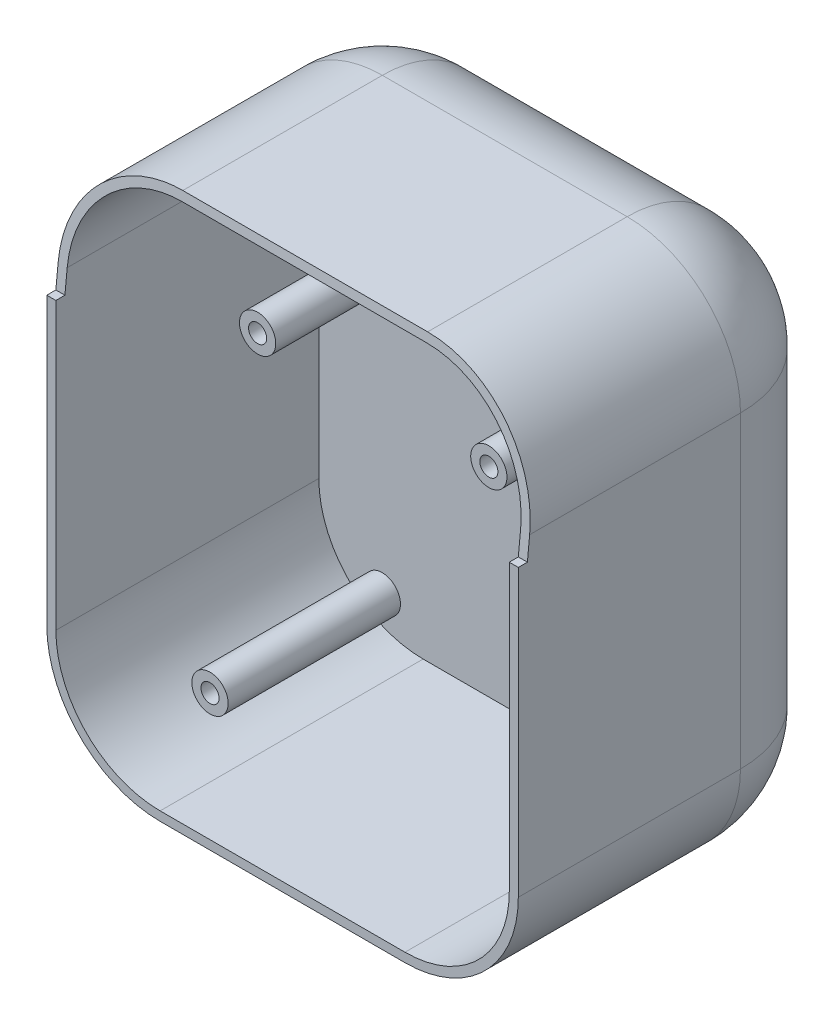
ISO-10303-21;
HEADER;
FILE_DESCRIPTION(('STEP AP214'),'2;1');
FILE_NAME('part.step','',(''),(''),'','','');
FILE_SCHEMA(('AUTOMOTIVE_DESIGN { 1 0 10303 214 1 1 1 1 }'));
ENDSEC;
DATA;
#1=APPLICATION_CONTEXT('core data for automotive mechanical design processes');
#2=APPLICATION_PROTOCOL_DEFINITION('international standard','automotive_design',2000,#1);
#3=PRODUCT_CONTEXT('',#1,'mechanical');
#4=PRODUCT('Part','Part','',(#3));
#5=PRODUCT_RELATED_PRODUCT_CATEGORY('part','',(#4));
#6=PRODUCT_DEFINITION_FORMATION('','',#4);
#7=PRODUCT_DEFINITION_CONTEXT('part definition',#1,'design');
#8=PRODUCT_DEFINITION('design','',#6,#7);
#9=PRODUCT_DEFINITION_SHAPE('','',#8);
#10=(LENGTH_UNIT() NAMED_UNIT(*) SI_UNIT(.MILLI.,.METRE.));
#11=(NAMED_UNIT(*) PLANE_ANGLE_UNIT() SI_UNIT($,.RADIAN.));
#12=(NAMED_UNIT(*) SI_UNIT($,.STERADIAN.) SOLID_ANGLE_UNIT());
#13=UNCERTAINTY_MEASURE_WITH_UNIT(LENGTH_MEASURE(1.E-05),#10,'distance_accuracy_value','');
#14=(GEOMETRIC_REPRESENTATION_CONTEXT(3) GLOBAL_UNCERTAINTY_ASSIGNED_CONTEXT((#13)) GLOBAL_UNIT_ASSIGNED_CONTEXT((#10,
#11,#12)) REPRESENTATION_CONTEXT('',''));
#15=CARTESIAN_POINT('',(0.,0.,0.));
#16=DIRECTION('',(0.,0.,1.));
#17=DIRECTION('',(1.,0.,0.));
#18=AXIS2_PLACEMENT_3D('',#15,#16,#17);
#19=CARTESIAN_POINT('',(-36.,-49.,-0.001000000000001));
#20=DIRECTION('',(0.,0.,1.));
#21=DIRECTION('',(1.,0.,0.));
#22=AXIS2_PLACEMENT_3D('',#19,#20,#21);
#23=CYLINDRICAL_SURFACE('',#22,4.);
#24=CARTESIAN_POINT('',(-36.,-49.,2.));
#25=DIRECTION('',(0.,0.,1.));
#26=DIRECTION('',(1.,0.,0.));
#27=AXIS2_PLACEMENT_3D('',#24,#25,#26);
#28=CIRCLE('',#27,4.);
#29=CARTESIAN_POINT('',(-32.,-49.,2.));
#30=VERTEX_POINT('',#29);
#31=EDGE_CURVE('E611',#30,#30,#28,.F.);
#32=ORIENTED_EDGE('',*,*,#31,.F.);
#33=EDGE_LOOP('',(#32));
#34=FACE_BOUND('',#33,.T.);
#35=CARTESIAN_POINT('',(-36.,-49.,40.));
#36=DIRECTION('',(0.,0.,1.));
#37=DIRECTION('',(1.,0.,0.));
#38=AXIS2_PLACEMENT_3D('',#35,#36,#37);
#39=CIRCLE('',#38,4.00000000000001);
#40=CARTESIAN_POINT('',(-32.,-49.,40.));
#41=VERTEX_POINT('',#40);
#42=EDGE_CURVE('E548',#41,#41,#39,.T.);
#43=ORIENTED_EDGE('',*,*,#42,.F.);
#44=EDGE_LOOP('',(#43));
#45=FACE_BOUND('',#44,.T.);
#46=ADVANCED_FACE('F348',(#34,#45),#23,.T.);
#47=CARTESIAN_POINT('',(-25.5,25.,-0.001000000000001));
#48=DIRECTION('',(0.,0.,1.));
#49=DIRECTION('',(1.,0.,0.));
#50=AXIS2_PLACEMENT_3D('',#47,#48,#49);
#51=CYLINDRICAL_SURFACE('',#50,4.);
#52=CARTESIAN_POINT('',(-25.5,25.,2.));
#53=DIRECTION('',(0.,0.,1.));
#54=DIRECTION('',(1.,0.,0.));
#55=AXIS2_PLACEMENT_3D('',#52,#53,#54);
#56=CIRCLE('',#55,4.);
#57=CARTESIAN_POINT('',(-21.5,25.,2.));
#58=VERTEX_POINT('',#57);
#59=EDGE_CURVE('E653',#58,#58,#56,.F.);
#60=ORIENTED_EDGE('',*,*,#59,.F.);
#61=EDGE_LOOP('',(#60));
#62=FACE_BOUND('',#61,.T.);
#63=CARTESIAN_POINT('',(-25.5,25.,40.));
#64=DIRECTION('',(0.,0.,1.));
#65=DIRECTION('',(1.,0.,0.));
#66=AXIS2_PLACEMENT_3D('',#63,#64,#65);
#67=CIRCLE('',#66,4.);
#68=CARTESIAN_POINT('',(-21.5,25.,40.));
#69=VERTEX_POINT('',#68);
#70=EDGE_CURVE('E554',#69,#69,#67,.T.);
#71=ORIENTED_EDGE('',*,*,#70,.F.);
#72=EDGE_LOOP('',(#71));
#73=FACE_BOUND('',#72,.T.);
#74=ADVANCED_FACE('F831',(#62,#73),#51,.T.);
#75=CARTESIAN_POINT('',(25.5,25.,-0.001000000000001));
#76=DIRECTION('',(0.,0.,1.));
#77=DIRECTION('',(1.,0.,0.));
#78=AXIS2_PLACEMENT_3D('',#75,#76,#77);
#79=CYLINDRICAL_SURFACE('',#78,4.);
#80=CARTESIAN_POINT('',(25.5,25.,2.));
#81=DIRECTION('',(0.,0.,1.));
#82=DIRECTION('',(1.,0.,0.));
#83=AXIS2_PLACEMENT_3D('',#80,#81,#82);
#84=CIRCLE('',#83,4.);
#85=CARTESIAN_POINT('',(29.5,25.,2.));
#86=VERTEX_POINT('',#85);
#87=EDGE_CURVE('E606',#86,#86,#84,.F.);
#88=ORIENTED_EDGE('',*,*,#87,.F.);
#89=EDGE_LOOP('',(#88));
#90=FACE_BOUND('',#89,.T.);
#91=CARTESIAN_POINT('',(25.5,25.,40.));
#92=DIRECTION('',(0.,0.,1.));
#93=DIRECTION('',(1.,0.,0.));
#94=AXIS2_PLACEMENT_3D('',#91,#92,#93);
#95=CIRCLE('',#94,4.);
#96=CARTESIAN_POINT('',(29.5,25.,40.));
#97=VERTEX_POINT('',#96);
#98=EDGE_CURVE('E560',#97,#97,#95,.T.);
#99=ORIENTED_EDGE('',*,*,#98,.F.);
#100=EDGE_LOOP('',(#99));
#101=FACE_BOUND('',#100,.T.);
#102=ADVANCED_FACE('F838',(#90,#101),#79,.T.);
#103=CARTESIAN_POINT('',(36.,-49.,-0.001000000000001));
#104=DIRECTION('',(0.,0.,1.));
#105=DIRECTION('',(1.,0.,0.));
#106=AXIS2_PLACEMENT_3D('',#103,#104,#105);
#107=CYLINDRICAL_SURFACE('',#106,4.);
#108=CARTESIAN_POINT('',(36.,-49.,2.));
#109=DIRECTION('',(0.,0.,1.));
#110=DIRECTION('',(1.,0.,0.));
#111=AXIS2_PLACEMENT_3D('',#108,#109,#110);
#112=CIRCLE('',#111,4.);
#113=CARTESIAN_POINT('',(40.,-49.,2.));
#114=VERTEX_POINT('',#113);
#115=EDGE_CURVE('E656',#114,#114,#112,.F.);
#116=ORIENTED_EDGE('',*,*,#115,.F.);
#117=EDGE_LOOP('',(#116));
#118=FACE_BOUND('',#117,.T.);
#119=CARTESIAN_POINT('',(36.,-49.,40.));
#120=DIRECTION('',(0.,0.,1.));
#121=DIRECTION('',(1.,0.,0.));
#122=AXIS2_PLACEMENT_3D('',#119,#120,#121);
#123=CIRCLE('',#122,4.00000000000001);
#124=CARTESIAN_POINT('',(40.,-49.,40.));
#125=VERTEX_POINT('',#124);
#126=EDGE_CURVE('E566',#125,#125,#123,.T.);
#127=ORIENTED_EDGE('',*,*,#126,.F.);
#128=EDGE_LOOP('',(#127));
#129=FACE_BOUND('',#128,.T.);
#130=ADVANCED_FACE('F846',(#118,#129),#107,.T.);
#131=CARTESIAN_POINT('',(-27.,34.,60.));
#132=DIRECTION('',(0.,0.,-1.));
#133=DIRECTION('',(-1.,0.,0.));
#134=AXIS2_PLACEMENT_3D('',#131,#132,#133);
#135=CYLINDRICAL_SURFACE('',#134,25.);
#136=DIRECTION('',(0.,0.,-1.));
#137=VECTOR('',#136,1.);
#138=CARTESIAN_POINT('',(-52.,34.,60.));
#139=LINE('',#138,#137);
#140=CARTESIAN_POINT('',(-52.,34.,57.5));
#141=VERTEX_POINT('',#140);
#142=CARTESIAN_POINT('',(-52.,34.,11.));
#143=VERTEX_POINT('',#142);
#144=EDGE_CURVE('E695',#141,#143,#139,.T.);
#145=ORIENTED_EDGE('',*,*,#144,.F.);
#146=CARTESIAN_POINT('',(-27.,34.,57.5));
#147=DIRECTION('',(0.,-0.0995037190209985,-0.995037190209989));
#148=DIRECTION('',(0.,0.995037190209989,-0.0995037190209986));
#149=AXIS2_PLACEMENT_3D('',#146,#147,#148);
#150=ELLIPSE('',#149,25.1246890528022,25.);
#151=CARTESIAN_POINT('',(-27.,59.,55.));
#152=VERTEX_POINT('',#151);
#153=EDGE_CURVE('E542',#141,#152,#150,.T.);
#154=ORIENTED_EDGE('',*,*,#153,.T.);
#155=DIRECTION('',(0.,0.,-1.));
#156=VECTOR('',#155,1.);
#157=CARTESIAN_POINT('',(-27.,59.,60.));
#158=LINE('',#157,#156);
#159=CARTESIAN_POINT('',(-27.,59.,11.));
#160=VERTEX_POINT('',#159);
#161=EDGE_CURVE('E371',#152,#160,#158,.T.);
#162=ORIENTED_EDGE('',*,*,#161,.T.);
#163=CARTESIAN_POINT('',(-27.,34.,11.));
#164=DIRECTION('',(0.,0.,-1.));
#165=DIRECTION('',(-1.,0.,0.));
#166=AXIS2_PLACEMENT_3D('',#163,#164,#165);
#167=CIRCLE('',#166,25.);
#168=EDGE_CURVE('E722',#160,#143,#167,.F.);
#169=ORIENTED_EDGE('',*,*,#168,.T.);
#170=EDGE_LOOP('',(#145,#154,#162,#169));
#171=FACE_BOUND('',#170,.T.);
#172=ADVANCED_FACE('F350',(#171),#135,.T.);
#173=CARTESIAN_POINT('',(-52.,34.,60.));
#174=DIRECTION('',(1.,0.,0.));
#175=DIRECTION('',(0.,1.,0.));
#176=AXIS2_PLACEMENT_3D('',#173,#174,#175);
#177=PLANE('',#176);
#178=DIRECTION('',(0.,0.,-1.));
#179=VECTOR('',#178,1.);
#180=CARTESIAN_POINT('',(-52.,29.,63.3901111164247));
#181=LINE('',#180,#179);
#182=CARTESIAN_POINT('',(-52.,29.,60.));
#183=VERTEX_POINT('',#182);
#184=CARTESIAN_POINT('',(-52.,29.,58.));
#185=VERTEX_POINT('',#184);
#186=EDGE_CURVE('E523',#183,#185,#181,.T.);
#187=ORIENTED_EDGE('',*,*,#186,.T.);
#188=DIRECTION('',(0.,0.995037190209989,-0.0995037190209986));
#189=VECTOR('',#188,1.);
#190=CARTESIAN_POINT('',(-52.,59.,55.));
#191=LINE('',#190,#189);
#192=EDGE_CURVE('E517',#185,#141,#191,.T.);
#193=ORIENTED_EDGE('',*,*,#192,.T.);
#194=ORIENTED_EDGE('',*,*,#144,.T.);
#195=DIRECTION('',(0.,1.,0.));
#196=VECTOR('',#195,1.);
#197=CARTESIAN_POINT('',(-52.,-34.,11.));
#198=LINE('',#197,#196);
#199=CARTESIAN_POINT('',(-52.,-34.,11.));
#200=VERTEX_POINT('',#199);
#201=EDGE_CURVE('E706',#143,#200,#198,.F.);
#202=ORIENTED_EDGE('',*,*,#201,.T.);
#203=DIRECTION('',(0.,0.,-1.));
#204=VECTOR('',#203,1.);
#205=CARTESIAN_POINT('',(-52.,-34.,60.));
#206=LINE('',#205,#204);
#207=CARTESIAN_POINT('',(-52.,-34.,60.));
#208=VERTEX_POINT('',#207);
#209=EDGE_CURVE('E692',#208,#200,#206,.T.);
#210=ORIENTED_EDGE('',*,*,#209,.F.);
#211=DIRECTION('',(0.,-1.,0.));
#212=VECTOR('',#211,1.);
#213=CARTESIAN_POINT('',(-52.,34.,60.));
#214=LINE('',#213,#212);
#215=EDGE_CURVE('E614',#183,#208,#214,.T.);
#216=ORIENTED_EDGE('',*,*,#215,.F.);
#217=EDGE_LOOP('',(#187,#193,#194,#202,#210,#216));
#218=FACE_BOUND('',#217,.T.);
#219=ADVANCED_FACE('F806',(#218),#177,.F.);
#220=CARTESIAN_POINT('',(-27.,-34.,60.));
#221=DIRECTION('',(0.,0.,-1.));
#222=DIRECTION('',(-1.,0.,0.));
#223=AXIS2_PLACEMENT_3D('',#220,#221,#222);
#224=CYLINDRICAL_SURFACE('',#223,25.);
#225=ORIENTED_EDGE('',*,*,#209,.T.);
#226=CARTESIAN_POINT('',(-27.,-34.,11.));
#227=DIRECTION('',(0.,0.,-1.));
#228=DIRECTION('',(-1.,0.,0.));
#229=AXIS2_PLACEMENT_3D('',#226,#227,#228);
#230=CIRCLE('',#229,25.);
#231=CARTESIAN_POINT('',(-27.,-59.,11.));
#232=VERTEX_POINT('',#231);
#233=EDGE_CURVE('E709',#200,#232,#230,.F.);
#234=ORIENTED_EDGE('',*,*,#233,.T.);
#235=DIRECTION('',(0.,0.,-1.));
#236=VECTOR('',#235,1.);
#237=CARTESIAN_POINT('',(-27.,-59.,60.));
#238=LINE('',#237,#236);
#239=CARTESIAN_POINT('',(-27.,-59.,60.));
#240=VERTEX_POINT('',#239);
#241=EDGE_CURVE('E689',#240,#232,#238,.T.);
#242=ORIENTED_EDGE('',*,*,#241,.F.);
#243=CARTESIAN_POINT('',(-27.,-34.,60.));
#244=DIRECTION('',(0.,0.,1.));
#245=DIRECTION('',(1.,0.,0.));
#246=AXIS2_PLACEMENT_3D('',#243,#244,#245);
#247=CIRCLE('',#246,25.);
#248=EDGE_CURVE('E671',#208,#240,#247,.T.);
#249=ORIENTED_EDGE('',*,*,#248,.F.);
#250=EDGE_LOOP('',(#225,#234,#242,#249));
#251=FACE_BOUND('',#250,.T.);
#252=ADVANCED_FACE('F815',(#251),#224,.T.);
#253=CARTESIAN_POINT('',(27.,-59.,60.));
#254=DIRECTION('',(0.,1.,0.));
#255=DIRECTION('',(0.,0.,1.));
#256=AXIS2_PLACEMENT_3D('',#253,#254,#255);
#257=PLANE('',#256);
#258=ORIENTED_EDGE('',*,*,#241,.T.);
#259=DIRECTION('',(-1.,0.,0.));
#260=VECTOR('',#259,1.);
#261=CARTESIAN_POINT('',(27.,-59.,11.));
#262=LINE('',#261,#260);
#263=CARTESIAN_POINT('',(27.,-59.,11.));
#264=VERTEX_POINT('',#263);
#265=EDGE_CURVE('E711',#232,#264,#262,.F.);
#266=ORIENTED_EDGE('',*,*,#265,.T.);
#267=DIRECTION('',(0.,0.,-1.));
#268=VECTOR('',#267,1.);
#269=CARTESIAN_POINT('',(27.,-59.,60.));
#270=LINE('',#269,#268);
#271=CARTESIAN_POINT('',(27.,-59.,60.));
#272=VERTEX_POINT('',#271);
#273=EDGE_CURVE('E686',#272,#264,#270,.T.);
#274=ORIENTED_EDGE('',*,*,#273,.F.);
#275=DIRECTION('',(1.,0.,0.));
#276=VECTOR('',#275,1.);
#277=CARTESIAN_POINT('',(27.,-59.,60.));
#278=LINE('',#277,#276);
#279=EDGE_CURVE('E673',#240,#272,#278,.T.);
#280=ORIENTED_EDGE('',*,*,#279,.F.);
#281=EDGE_LOOP('',(#258,#266,#274,#280));
#282=FACE_BOUND('',#281,.T.);
#283=ADVANCED_FACE('F819',(#282),#257,.F.);
#284=CARTESIAN_POINT('',(27.,-34.,60.));
#285=DIRECTION('',(0.,0.,-1.));
#286=DIRECTION('',(-1.,0.,0.));
#287=AXIS2_PLACEMENT_3D('',#284,#285,#286);
#288=CYLINDRICAL_SURFACE('',#287,25.);
#289=ORIENTED_EDGE('',*,*,#273,.T.);
#290=CARTESIAN_POINT('',(27.,-34.,11.));
#291=DIRECTION('',(0.,0.,-1.));
#292=DIRECTION('',(-1.,0.,0.));
#293=AXIS2_PLACEMENT_3D('',#290,#291,#292);
#294=CIRCLE('',#293,25.);
#295=CARTESIAN_POINT('',(52.,-34.,11.));
#296=VERTEX_POINT('',#295);
#297=EDGE_CURVE('E713',#264,#296,#294,.F.);
#298=ORIENTED_EDGE('',*,*,#297,.T.);
#299=DIRECTION('',(0.,0.,-1.));
#300=VECTOR('',#299,1.);
#301=CARTESIAN_POINT('',(52.,-34.,60.));
#302=LINE('',#301,#300);
#303=CARTESIAN_POINT('',(52.,-34.,60.));
#304=VERTEX_POINT('',#303);
#305=EDGE_CURVE('E683',#304,#296,#302,.T.);
#306=ORIENTED_EDGE('',*,*,#305,.F.);
#307=CARTESIAN_POINT('',(27.,-34.,60.));
#308=DIRECTION('',(0.,0.,1.));
#309=DIRECTION('',(1.,0.,0.));
#310=AXIS2_PLACEMENT_3D('',#307,#308,#309);
#311=CIRCLE('',#310,25.);
#312=EDGE_CURVE('E675',#272,#304,#311,.T.);
#313=ORIENTED_EDGE('',*,*,#312,.F.);
#314=EDGE_LOOP('',(#289,#298,#306,#313));
#315=FACE_BOUND('',#314,.T.);
#316=ADVANCED_FACE('F820',(#315),#288,.T.);
#317=CARTESIAN_POINT('',(52.,34.,60.));
#318=DIRECTION('',(-1.,0.,0.));
#319=DIRECTION('',(0.,0.,1.));
#320=AXIS2_PLACEMENT_3D('',#317,#318,#319);
#321=PLANE('',#320);
#322=DIRECTION('',(0.,0.,-1.));
#323=VECTOR('',#322,1.);
#324=CARTESIAN_POINT('',(52.,34.,60.));
#325=LINE('',#324,#323);
#326=CARTESIAN_POINT('',(52.,34.,57.5));
#327=VERTEX_POINT('',#326);
#328=CARTESIAN_POINT('',(52.,34.,11.));
#329=VERTEX_POINT('',#328);
#330=EDGE_CURVE('E522',#327,#329,#325,.T.);
#331=ORIENTED_EDGE('',*,*,#330,.F.);
#332=DIRECTION('',(0.,0.995037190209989,-0.0995037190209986));
#333=VECTOR('',#332,1.);
#334=CARTESIAN_POINT('',(52.,59.,55.));
#335=LINE('',#334,#333);
#336=CARTESIAN_POINT('',(52.,29.,58.));
#337=VERTEX_POINT('',#336);
#338=EDGE_CURVE('E509',#337,#327,#335,.T.);
#339=ORIENTED_EDGE('',*,*,#338,.F.);
#340=DIRECTION('',(0.,0.,-1.));
#341=VECTOR('',#340,1.);
#342=CARTESIAN_POINT('',(52.,29.,63.3901111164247));
#343=LINE('',#342,#341);
#344=CARTESIAN_POINT('',(52.,29.,60.));
#345=VERTEX_POINT('',#344);
#346=EDGE_CURVE('E498',#345,#337,#343,.T.);
#347=ORIENTED_EDGE('',*,*,#346,.F.);
#348=DIRECTION('',(0.,1.,0.));
#349=VECTOR('',#348,1.);
#350=CARTESIAN_POINT('',(52.,34.,60.));
#351=LINE('',#350,#349);
#352=EDGE_CURVE('E677',#304,#345,#351,.T.);
#353=ORIENTED_EDGE('',*,*,#352,.F.);
#354=ORIENTED_EDGE('',*,*,#305,.T.);
#355=DIRECTION('',(0.,-1.,0.));
#356=VECTOR('',#355,1.);
#357=CARTESIAN_POINT('',(52.,34.,11.));
#358=LINE('',#357,#356);
#359=EDGE_CURVE('E715',#296,#329,#358,.F.);
#360=ORIENTED_EDGE('',*,*,#359,.T.);
#361=EDGE_LOOP('',(#331,#339,#347,#353,#354,#360));
#362=FACE_BOUND('',#361,.T.);
#363=ADVANCED_FACE('F520',(#362),#321,.F.);
#364=CARTESIAN_POINT('',(27.,34.,60.));
#365=DIRECTION('',(0.,0.,-1.));
#366=DIRECTION('',(-1.,0.,0.));
#367=AXIS2_PLACEMENT_3D('',#364,#365,#366);
#368=CYLINDRICAL_SURFACE('',#367,25.);
#369=DIRECTION('',(0.,0.,-1.));
#370=VECTOR('',#369,1.);
#371=CARTESIAN_POINT('',(27.,59.,60.));
#372=LINE('',#371,#370);
#373=CARTESIAN_POINT('',(27.,59.,55.));
#374=VERTEX_POINT('',#373);
#375=CARTESIAN_POINT('',(27.,59.,11.));
#376=VERTEX_POINT('',#375);
#377=EDGE_CURVE('E680',#374,#376,#372,.T.);
#378=ORIENTED_EDGE('',*,*,#377,.F.);
#379=CARTESIAN_POINT('',(27.,34.,57.5));
#380=DIRECTION('',(0.,-0.0995037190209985,-0.995037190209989));
#381=DIRECTION('',(0.,0.995037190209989,-0.0995037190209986));
#382=AXIS2_PLACEMENT_3D('',#379,#380,#381);
#383=ELLIPSE('',#382,25.1246890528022,25.);
#384=EDGE_CURVE('E540',#374,#327,#383,.T.);
#385=ORIENTED_EDGE('',*,*,#384,.T.);
#386=ORIENTED_EDGE('',*,*,#330,.T.);
#387=CARTESIAN_POINT('',(27.,34.,11.));
#388=DIRECTION('',(0.,0.,-1.));
#389=DIRECTION('',(-1.,0.,0.));
#390=AXIS2_PLACEMENT_3D('',#387,#388,#389);
#391=CIRCLE('',#390,25.);
#392=EDGE_CURVE('E717',#329,#376,#391,.F.);
#393=ORIENTED_EDGE('',*,*,#392,.T.);
#394=EDGE_LOOP('',(#378,#385,#386,#393));
#395=FACE_BOUND('',#394,.T.);
#396=ADVANCED_FACE('F802',(#395),#368,.T.);
#397=CARTESIAN_POINT('',(27.,59.,60.));
#398=DIRECTION('',(0.,-1.,0.));
#399=DIRECTION('',(1.,0.,0.));
#400=AXIS2_PLACEMENT_3D('',#397,#398,#399);
#401=PLANE('',#400);
#402=ORIENTED_EDGE('',*,*,#161,.F.);
#403=DIRECTION('',(1.,0.,0.));
#404=VECTOR('',#403,1.);
#405=CARTESIAN_POINT('',(-52.,59.,55.));
#406=LINE('',#405,#404);
#407=EDGE_CURVE('E530',#152,#374,#406,.T.);
#408=ORIENTED_EDGE('',*,*,#407,.T.);
#409=ORIENTED_EDGE('',*,*,#377,.T.);
#410=DIRECTION('',(1.,0.,0.));
#411=VECTOR('',#410,1.);
#412=CARTESIAN_POINT('',(-27.,59.,11.));
#413=LINE('',#412,#411);
#414=EDGE_CURVE('E720',#376,#160,#413,.F.);
#415=ORIENTED_EDGE('',*,*,#414,.T.);
#416=EDGE_LOOP('',(#402,#408,#409,#415));
#417=FACE_BOUND('',#416,.T.);
#418=ADVANCED_FACE('F799',(#417),#401,.F.);
#419=CARTESIAN_POINT('',(-27.,34.,60.));
#420=DIRECTION('',(0.,0.,1.));
#421=DIRECTION('',(1.,0.,0.));
#422=AXIS2_PLACEMENT_3D('',#419,#420,#421);
#423=PLANE('',#422);
#424=DIRECTION('',(1.,0.,0.));
#425=VECTOR('',#424,1.);
#426=CARTESIAN_POINT('',(-27.,29.,60.));
#427=LINE('',#426,#425);
#428=CARTESIAN_POINT('',(-50.,29.,60.));
#429=VERTEX_POINT('',#428);
#430=EDGE_CURVE('E546',#183,#429,#427,.T.);
#431=ORIENTED_EDGE('',*,*,#430,.F.);
#432=ORIENTED_EDGE('',*,*,#215,.T.);
#433=ORIENTED_EDGE('',*,*,#248,.T.);
#434=ORIENTED_EDGE('',*,*,#279,.T.);
#435=ORIENTED_EDGE('',*,*,#312,.T.);
#436=ORIENTED_EDGE('',*,*,#352,.T.);
#437=CARTESIAN_POINT('',(50.,29.,60.));
#438=VERTEX_POINT('',#437);
#439=EDGE_CURVE('E504',#438,#345,#427,.T.);
#440=ORIENTED_EDGE('',*,*,#439,.F.);
#441=DIRECTION('',(0.,1.,0.));
#442=VECTOR('',#441,1.);
#443=CARTESIAN_POINT('',(50.,34.,60.));
#444=LINE('',#443,#442);
#445=CARTESIAN_POINT('',(50.,-34.,60.));
#446=VERTEX_POINT('',#445);
#447=EDGE_CURVE('E619',#446,#438,#444,.T.);
#448=ORIENTED_EDGE('',*,*,#447,.F.);
#449=CARTESIAN_POINT('',(27.,-34.,60.));
#450=DIRECTION('',(0.,0.,1.));
#451=DIRECTION('',(1.,0.,0.));
#452=AXIS2_PLACEMENT_3D('',#449,#450,#451);
#453=CIRCLE('',#452,23.);
#454=CARTESIAN_POINT('',(27.,-57.,60.));
#455=VERTEX_POINT('',#454);
#456=EDGE_CURVE('E666',#455,#446,#453,.T.);
#457=ORIENTED_EDGE('',*,*,#456,.F.);
#458=DIRECTION('',(1.,0.,0.));
#459=VECTOR('',#458,1.);
#460=CARTESIAN_POINT('',(27.,-57.,60.));
#461=LINE('',#460,#459);
#462=CARTESIAN_POINT('',(-27.,-57.,60.));
#463=VERTEX_POINT('',#462);
#464=EDGE_CURVE('E664',#463,#455,#461,.T.);
#465=ORIENTED_EDGE('',*,*,#464,.F.);
#466=CARTESIAN_POINT('',(-27.,-34.,60.));
#467=DIRECTION('',(0.,0.,1.));
#468=DIRECTION('',(1.,0.,0.));
#469=AXIS2_PLACEMENT_3D('',#466,#467,#468);
#470=CIRCLE('',#469,23.);
#471=CARTESIAN_POINT('',(-50.,-34.,60.));
#472=VERTEX_POINT('',#471);
#473=EDGE_CURVE('E662',#472,#463,#470,.T.);
#474=ORIENTED_EDGE('',*,*,#473,.F.);
#475=DIRECTION('',(0.,-1.,0.));
#476=VECTOR('',#475,1.);
#477=CARTESIAN_POINT('',(-50.,34.,60.));
#478=LINE('',#477,#476);
#479=EDGE_CURVE('E650',#429,#472,#478,.T.);
#480=ORIENTED_EDGE('',*,*,#479,.F.);
#481=EDGE_LOOP('',(#431,#432,#433,#434,#435,#436,#440,#448,#457,#465,#474,#480));
#482=FACE_BOUND('',#481,.T.);
#483=ADVANCED_FACE('F765',(#482),#423,.T.);
#484=CARTESIAN_POINT('',(-27.,34.,60.));
#485=DIRECTION('',(0.,0.,-1.));
#486=DIRECTION('',(-1.,0.,0.));
#487=AXIS2_PLACEMENT_3D('',#484,#485,#486);
#488=CYLINDRICAL_SURFACE('',#487,23.);
#489=CARTESIAN_POINT('',(-27.,34.,57.5));
#490=DIRECTION('',(0.,-0.0995037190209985,-0.995037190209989));
#491=DIRECTION('',(0.,0.995037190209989,-0.0995037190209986));
#492=AXIS2_PLACEMENT_3D('',#489,#490,#491);
#493=ELLIPSE('',#492,23.114713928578,23.);
#494=CARTESIAN_POINT('',(-50.,34.,57.5));
#495=VERTEX_POINT('',#494);
#496=CARTESIAN_POINT('',(-27.,57.,55.2));
#497=VERTEX_POINT('',#496);
#498=EDGE_CURVE('E363',#495,#497,#493,.T.);
#499=ORIENTED_EDGE('',*,*,#498,.F.);
#500=DIRECTION('',(0.,0.,1.));
#501=VECTOR('',#500,1.);
#502=CARTESIAN_POINT('',(-50.,34.,60.));
#503=LINE('',#502,#501);
#504=CARTESIAN_POINT('',(-50.,34.,2.));
#505=VERTEX_POINT('',#504);
#506=EDGE_CURVE('E612',#495,#505,#503,.F.);
#507=ORIENTED_EDGE('',*,*,#506,.T.);
#508=CARTESIAN_POINT('',(-27.,34.,2.));
#509=DIRECTION('',(0.,0.,1.));
#510=DIRECTION('',(1.,0.,0.));
#511=AXIS2_PLACEMENT_3D('',#508,#509,#510);
#512=CIRCLE('',#511,23.);
#513=CARTESIAN_POINT('',(-27.,57.,2.));
#514=VERTEX_POINT('',#513);
#515=EDGE_CURVE('E607',#514,#505,#512,.T.);
#516=ORIENTED_EDGE('',*,*,#515,.F.);
#517=DIRECTION('',(0.,0.,-1.));
#518=VECTOR('',#517,1.);
#519=CARTESIAN_POINT('',(-27.,57.,60.));
#520=LINE('',#519,#518);
#521=EDGE_CURVE('E616',#497,#514,#520,.T.);
#522=ORIENTED_EDGE('',*,*,#521,.F.);
#523=EDGE_LOOP('',(#499,#507,#516,#522));
#524=FACE_BOUND('',#523,.T.);
#525=ADVANCED_FACE('F737',(#524),#488,.F.);
#526=CARTESIAN_POINT('',(-50.,34.,60.));
#527=DIRECTION('',(1.,0.,0.));
#528=DIRECTION('',(0.,1.,0.));
#529=AXIS2_PLACEMENT_3D('',#526,#527,#528);
#530=PLANE('',#529);
#531=DIRECTION('',(0.,0.995037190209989,-0.0995037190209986));
#532=VECTOR('',#531,1.);
#533=CARTESIAN_POINT('',(-50.,33.7524752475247,57.5247524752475));
#534=LINE('',#533,#532);
#535=CARTESIAN_POINT('',(-50.,29.,58.));
#536=VERTEX_POINT('',#535);
#537=EDGE_CURVE('E538',#536,#495,#534,.T.);
#538=ORIENTED_EDGE('',*,*,#537,.F.);
#539=DIRECTION('',(0.,0.,-1.));
#540=VECTOR('',#539,1.);
#541=CARTESIAN_POINT('',(-50.,29.,60.));
#542=LINE('',#541,#540);
#543=EDGE_CURVE('E545',#429,#536,#542,.T.);
#544=ORIENTED_EDGE('',*,*,#543,.F.);
#545=ORIENTED_EDGE('',*,*,#479,.T.);
#546=DIRECTION('',(0.,0.,-1.));
#547=VECTOR('',#546,1.);
#548=CARTESIAN_POINT('',(-50.,-34.,60.));
#549=LINE('',#548,#547);
#550=CARTESIAN_POINT('',(-50.,-34.,2.));
#551=VERTEX_POINT('',#550);
#552=EDGE_CURVE('E615',#472,#551,#549,.T.);
#553=ORIENTED_EDGE('',*,*,#552,.T.);
#554=DIRECTION('',(0.,-1.,0.));
#555=VECTOR('',#554,1.);
#556=CARTESIAN_POINT('',(-50.,34.,2.));
#557=LINE('',#556,#555);
#558=EDGE_CURVE('E610',#505,#551,#557,.T.);
#559=ORIENTED_EDGE('',*,*,#558,.F.);
#560=ORIENTED_EDGE('',*,*,#506,.F.);
#561=EDGE_LOOP('',(#538,#544,#545,#553,#559,#560));
#562=FACE_BOUND('',#561,.T.);
#563=ADVANCED_FACE('F742',(#562),#530,.T.);
#564=CARTESIAN_POINT('',(-27.,-34.,60.));
#565=DIRECTION('',(0.,0.,-1.));
#566=DIRECTION('',(-1.,0.,0.));
#567=AXIS2_PLACEMENT_3D('',#564,#565,#566);
#568=CYLINDRICAL_SURFACE('',#567,23.);
#569=CARTESIAN_POINT('',(-27.,-34.,2.));
#570=DIRECTION('',(0.,0.,1.));
#571=DIRECTION('',(1.,0.,0.));
#572=AXIS2_PLACEMENT_3D('',#569,#570,#571);
#573=CIRCLE('',#572,23.);
#574=CARTESIAN_POINT('',(-27.,-57.,2.));
#575=VERTEX_POINT('',#574);
#576=EDGE_CURVE('E621',#551,#575,#573,.T.);
#577=ORIENTED_EDGE('',*,*,#576,.F.);
#578=ORIENTED_EDGE('',*,*,#552,.F.);
#579=ORIENTED_EDGE('',*,*,#473,.T.);
#580=DIRECTION('',(0.,0.,1.));
#581=VECTOR('',#580,1.);
#582=CARTESIAN_POINT('',(-27.,-57.,60.));
#583=LINE('',#582,#581);
#584=EDGE_CURVE('E624',#463,#575,#583,.F.);
#585=ORIENTED_EDGE('',*,*,#584,.T.);
#586=EDGE_LOOP('',(#577,#578,#579,#585));
#587=FACE_BOUND('',#586,.T.);
#588=ADVANCED_FACE('F748',(#587),#568,.F.);
#589=CARTESIAN_POINT('',(27.,-57.,60.));
#590=DIRECTION('',(0.,1.,0.));
#591=DIRECTION('',(0.,0.,1.));
#592=AXIS2_PLACEMENT_3D('',#589,#590,#591);
#593=PLANE('',#592);
#594=DIRECTION('',(1.,0.,0.));
#595=VECTOR('',#594,1.);
#596=CARTESIAN_POINT('',(27.,-57.,2.));
#597=LINE('',#596,#595);
#598=CARTESIAN_POINT('',(27.,-57.,2.));
#599=VERTEX_POINT('',#598);
#600=EDGE_CURVE('E626',#575,#599,#597,.T.);
#601=ORIENTED_EDGE('',*,*,#600,.F.);
#602=ORIENTED_EDGE('',*,*,#584,.F.);
#603=ORIENTED_EDGE('',*,*,#464,.T.);
#604=DIRECTION('',(0.,0.,-1.));
#605=VECTOR('',#604,1.);
#606=CARTESIAN_POINT('',(27.,-57.,60.));
#607=LINE('',#606,#605);
#608=EDGE_CURVE('E629',#455,#599,#607,.T.);
#609=ORIENTED_EDGE('',*,*,#608,.T.);
#610=EDGE_LOOP('',(#601,#602,#603,#609));
#611=FACE_BOUND('',#610,.T.);
#612=ADVANCED_FACE('F752',(#611),#593,.T.);
#613=CARTESIAN_POINT('',(27.,-34.,60.));
#614=DIRECTION('',(0.,0.,-1.));
#615=DIRECTION('',(-1.,0.,0.));
#616=AXIS2_PLACEMENT_3D('',#613,#614,#615);
#617=CYLINDRICAL_SURFACE('',#616,23.);
#618=CARTESIAN_POINT('',(27.,-34.,2.));
#619=DIRECTION('',(0.,0.,1.));
#620=DIRECTION('',(1.,0.,0.));
#621=AXIS2_PLACEMENT_3D('',#618,#619,#620);
#622=CIRCLE('',#621,23.);
#623=CARTESIAN_POINT('',(50.,-34.,2.));
#624=VERTEX_POINT('',#623);
#625=EDGE_CURVE('E631',#599,#624,#622,.T.);
#626=ORIENTED_EDGE('',*,*,#625,.F.);
#627=ORIENTED_EDGE('',*,*,#608,.F.);
#628=ORIENTED_EDGE('',*,*,#456,.T.);
#629=DIRECTION('',(0.,0.,1.));
#630=VECTOR('',#629,1.);
#631=CARTESIAN_POINT('',(50.,-34.,60.));
#632=LINE('',#631,#630);
#633=EDGE_CURVE('E634',#446,#624,#632,.F.);
#634=ORIENTED_EDGE('',*,*,#633,.T.);
#635=EDGE_LOOP('',(#626,#627,#628,#634));
#636=FACE_BOUND('',#635,.T.);
#637=ADVANCED_FACE('F757',(#636),#617,.F.);
#638=CARTESIAN_POINT('',(50.,34.,60.));
#639=DIRECTION('',(-1.,0.,0.));
#640=DIRECTION('',(0.,0.,1.));
#641=AXIS2_PLACEMENT_3D('',#638,#639,#640);
#642=PLANE('',#641);
#643=DIRECTION('',(0.,-0.995037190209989,0.0995037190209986));
#644=VECTOR('',#643,1.);
#645=CARTESIAN_POINT('',(50.,33.7524752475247,57.5247524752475));
#646=LINE('',#645,#644);
#647=CARTESIAN_POINT('',(50.,34.,57.5));
#648=VERTEX_POINT('',#647);
#649=CARTESIAN_POINT('',(50.,29.,58.));
#650=VERTEX_POINT('',#649);
#651=EDGE_CURVE('E515',#648,#650,#646,.T.);
#652=ORIENTED_EDGE('',*,*,#651,.F.);
#653=DIRECTION('',(0.,0.,-1.));
#654=VECTOR('',#653,1.);
#655=CARTESIAN_POINT('',(50.,34.,60.));
#656=LINE('',#655,#654);
#657=CARTESIAN_POINT('',(50.,34.,2.));
#658=VERTEX_POINT('',#657);
#659=EDGE_CURVE('E639',#648,#658,#656,.T.);
#660=ORIENTED_EDGE('',*,*,#659,.T.);
#661=DIRECTION('',(0.,1.,0.));
#662=VECTOR('',#661,1.);
#663=CARTESIAN_POINT('',(50.,34.,2.));
#664=LINE('',#663,#662);
#665=EDGE_CURVE('E636',#624,#658,#664,.T.);
#666=ORIENTED_EDGE('',*,*,#665,.F.);
#667=ORIENTED_EDGE('',*,*,#633,.F.);
#668=ORIENTED_EDGE('',*,*,#447,.T.);
#669=DIRECTION('',(0.,0.,1.));
#670=VECTOR('',#669,1.);
#671=CARTESIAN_POINT('',(50.,29.,60.));
#672=LINE('',#671,#670);
#673=EDGE_CURVE('E11',#650,#438,#672,.T.);
#674=ORIENTED_EDGE('',*,*,#673,.F.);
#675=EDGE_LOOP('',(#652,#660,#666,#667,#668,#674));
#676=FACE_BOUND('',#675,.T.);
#677=ADVANCED_FACE('F761',(#676),#642,.T.);
#678=CARTESIAN_POINT('',(27.,34.,60.));
#679=DIRECTION('',(0.,0.,-1.));
#680=DIRECTION('',(-1.,0.,0.));
#681=AXIS2_PLACEMENT_3D('',#678,#679,#680);
#682=CYLINDRICAL_SURFACE('',#681,23.);
#683=CARTESIAN_POINT('',(27.,34.,57.5));
#684=DIRECTION('',(0.,-0.0995037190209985,-0.995037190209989));
#685=DIRECTION('',(0.,0.995037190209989,-0.0995037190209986));
#686=AXIS2_PLACEMENT_3D('',#683,#684,#685);
#687=ELLIPSE('',#686,23.1147139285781,23.);
#688=CARTESIAN_POINT('',(27.,57.,55.2));
#689=VERTEX_POINT('',#688);
#690=EDGE_CURVE('E532',#689,#648,#687,.T.);
#691=ORIENTED_EDGE('',*,*,#690,.F.);
#692=DIRECTION('',(0.,0.,1.));
#693=VECTOR('',#692,1.);
#694=CARTESIAN_POINT('',(27.,57.,60.));
#695=LINE('',#694,#693);
#696=CARTESIAN_POINT('',(27.,57.,2.));
#697=VERTEX_POINT('',#696);
#698=EDGE_CURVE('E618',#689,#697,#695,.F.);
#699=ORIENTED_EDGE('',*,*,#698,.T.);
#700=CARTESIAN_POINT('',(27.,34.,2.));
#701=DIRECTION('',(0.,0.,1.));
#702=DIRECTION('',(1.,0.,0.));
#703=AXIS2_PLACEMENT_3D('',#700,#701,#702);
#704=CIRCLE('',#703,23.);
#705=EDGE_CURVE('E642',#658,#697,#704,.T.);
#706=ORIENTED_EDGE('',*,*,#705,.F.);
#707=ORIENTED_EDGE('',*,*,#659,.F.);
#708=EDGE_LOOP('',(#691,#699,#706,#707));
#709=FACE_BOUND('',#708,.T.);
#710=ADVANCED_FACE('F729',(#709),#682,.F.);
#711=CARTESIAN_POINT('',(27.,57.,60.));
#712=DIRECTION('',(0.,-1.,0.));
#713=DIRECTION('',(1.,0.,0.));
#714=AXIS2_PLACEMENT_3D('',#711,#712,#713);
#715=PLANE('',#714);
#716=DIRECTION('',(1.,0.,0.));
#717=VECTOR('',#716,1.);
#718=CARTESIAN_POINT('',(27.,57.,55.2));
#719=LINE('',#718,#717);
#720=EDGE_CURVE('E356',#497,#689,#719,.T.);
#721=ORIENTED_EDGE('',*,*,#720,.F.);
#722=ORIENTED_EDGE('',*,*,#521,.T.);
#723=DIRECTION('',(-1.,0.,0.));
#724=VECTOR('',#723,1.);
#725=CARTESIAN_POINT('',(27.,57.,2.));
#726=LINE('',#725,#724);
#727=EDGE_CURVE('E646',#697,#514,#726,.T.);
#728=ORIENTED_EDGE('',*,*,#727,.F.);
#729=ORIENTED_EDGE('',*,*,#698,.F.);
#730=EDGE_LOOP('',(#721,#722,#728,#729));
#731=FACE_BOUND('',#730,.T.);
#732=ADVANCED_FACE('F732',(#731),#715,.T.);
#733=CARTESIAN_POINT('',(-27.,34.,2.));
#734=DIRECTION('',(0.,0.,1.));
#735=DIRECTION('',(1.,0.,0.));
#736=AXIS2_PLACEMENT_3D('',#733,#734,#735);
#737=PLANE('',#736);
#738=ORIENTED_EDGE('',*,*,#87,.T.);
#739=EDGE_LOOP('',(#738));
#740=FACE_BOUND('',#739,.T.);
#741=ORIENTED_EDGE('',*,*,#59,.T.);
#742=EDGE_LOOP('',(#741));
#743=FACE_BOUND('',#742,.T.);
#744=ORIENTED_EDGE('',*,*,#115,.T.);
#745=EDGE_LOOP('',(#744));
#746=FACE_BOUND('',#745,.T.);
#747=ORIENTED_EDGE('',*,*,#31,.T.);
#748=EDGE_LOOP('',(#747));
#749=FACE_BOUND('',#748,.T.);
#750=ORIENTED_EDGE('',*,*,#515,.T.);
#751=ORIENTED_EDGE('',*,*,#558,.T.);
#752=ORIENTED_EDGE('',*,*,#576,.T.);
#753=ORIENTED_EDGE('',*,*,#600,.T.);
#754=ORIENTED_EDGE('',*,*,#625,.T.);
#755=ORIENTED_EDGE('',*,*,#665,.T.);
#756=ORIENTED_EDGE('',*,*,#705,.T.);
#757=ORIENTED_EDGE('',*,*,#727,.T.);
#758=EDGE_LOOP('',(#750,#751,#752,#753,#754,#755,#756,#757));
#759=FACE_BOUND('',#758,.T.);
#760=ADVANCED_FACE('F735',(#740,#743,#746,#749,#759),#737,.T.);
#761=CARTESIAN_POINT('',(-27.,34.,-14.));
#762=DIRECTION('',(0.,0.,-1.));
#763=DIRECTION('',(-1.,0.,0.));
#764=AXIS2_PLACEMENT_3D('',#761,#762,#763);
#765=PLANE('',#764);
#766=DIRECTION('',(-1.,0.,0.));
#767=VECTOR('',#766,1.);
#768=CARTESIAN_POINT('',(-27.,-34.,-14.));
#769=LINE('',#768,#767);
#770=CARTESIAN_POINT('',(27.,-34.,-14.));
#771=VERTEX_POINT('',#770);
#772=CARTESIAN_POINT('',(-27.,-34.,-14.));
#773=VERTEX_POINT('',#772);
#774=EDGE_CURVE('E701',#771,#773,#769,.T.);
#775=ORIENTED_EDGE('',*,*,#774,.T.);
#776=DIRECTION('',(0.,1.,0.));
#777=VECTOR('',#776,1.);
#778=CARTESIAN_POINT('',(-27.,34.,-14.));
#779=LINE('',#778,#777);
#780=CARTESIAN_POINT('',(-27.,34.,-14.));
#781=VERTEX_POINT('',#780);
#782=EDGE_CURVE('E703',#773,#781,#779,.T.);
#783=ORIENTED_EDGE('',*,*,#782,.T.);
#784=DIRECTION('',(1.,0.,0.));
#785=VECTOR('',#784,1.);
#786=CARTESIAN_POINT('',(27.,34.,-14.));
#787=LINE('',#786,#785);
#788=CARTESIAN_POINT('',(27.,34.,-14.));
#789=VERTEX_POINT('',#788);
#790=EDGE_CURVE('E697',#781,#789,#787,.T.);
#791=ORIENTED_EDGE('',*,*,#790,.T.);
#792=DIRECTION('',(0.,-1.,0.));
#793=VECTOR('',#792,1.);
#794=CARTESIAN_POINT('',(27.,-34.,-14.));
#795=LINE('',#794,#793);
#796=EDGE_CURVE('E699',#789,#771,#795,.T.);
#797=ORIENTED_EDGE('',*,*,#796,.T.);
#798=EDGE_LOOP('',(#775,#783,#791,#797));
#799=FACE_BOUND('',#798,.T.);
#800=ADVANCED_FACE('F787',(#799),#765,.T.);
#801=CARTESIAN_POINT('',(27.,34.,11.));
#802=DIRECTION('',(0.,1.,0.));
#803=DIRECTION('',(0.,0.,1.));
#804=AXIS2_PLACEMENT_3D('',#801,#802,#803);
#805=CYLINDRICAL_SURFACE('',#804,25.);
#806=CARTESIAN_POINT('',(27.,34.,11.));
#807=DIRECTION('',(0.,1.,0.));
#808=DIRECTION('',(0.,0.,1.));
#809=AXIS2_PLACEMENT_3D('',#806,#807,#808);
#810=CIRCLE('',#809,25.);
#811=EDGE_CURVE('E588',#329,#789,#810,.T.);
#812=ORIENTED_EDGE('',*,*,#811,.F.);
#813=ORIENTED_EDGE('',*,*,#359,.F.);
#814=CARTESIAN_POINT('',(27.,-34.,11.));
#815=DIRECTION('',(0.,-1.,0.));
#816=DIRECTION('',(0.,0.,-1.));
#817=AXIS2_PLACEMENT_3D('',#814,#815,#816);
#818=CIRCLE('',#817,25.);
#819=EDGE_CURVE('E591',#771,#296,#818,.T.);
#820=ORIENTED_EDGE('',*,*,#819,.F.);
#821=ORIENTED_EDGE('',*,*,#796,.F.);
#822=EDGE_LOOP('',(#812,#813,#820,#821));
#823=FACE_BOUND('',#822,.T.);
#824=ADVANCED_FACE('F773',(#823),#805,.T.);
#825=CARTESIAN_POINT('',(27.,-34.,11.));
#826=DIRECTION('',(0.,0.,1.));
#827=DIRECTION('',(1.,0.,0.));
#828=AXIS2_PLACEMENT_3D('',#825,#826,#827);
#829=SPHERICAL_SURFACE('',#828,25.);
#830=ORIENTED_EDGE('',*,*,#819,.T.);
#831=ORIENTED_EDGE('',*,*,#297,.F.);
#832=CARTESIAN_POINT('',(27.,-34.,11.));
#833=DIRECTION('',(-1.,0.,0.));
#834=DIRECTION('',(0.,0.,1.));
#835=AXIS2_PLACEMENT_3D('',#832,#833,#834);
#836=CIRCLE('',#835,25.);
#837=EDGE_CURVE('E585',#771,#264,#836,.T.);
#838=ORIENTED_EDGE('',*,*,#837,.F.);
#839=EDGE_LOOP('',(#830,#831,#838));
#840=FACE_BOUND('',#839,.T.);
#841=ADVANCED_FACE('F779',(#840),#829,.T.);
#842=CARTESIAN_POINT('',(27.,34.,11.));
#843=DIRECTION('',(0.,0.,1.));
#844=DIRECTION('',(1.,0.,0.));
#845=AXIS2_PLACEMENT_3D('',#842,#843,#844);
#846=SPHERICAL_SURFACE('',#845,25.);
#847=ORIENTED_EDGE('',*,*,#392,.F.);
#848=ORIENTED_EDGE('',*,*,#811,.T.);
#849=CARTESIAN_POINT('',(27.,34.,11.));
#850=DIRECTION('',(-1.,0.,0.));
#851=DIRECTION('',(0.,-1.,0.));
#852=AXIS2_PLACEMENT_3D('',#849,#850,#851);
#853=CIRCLE('',#852,25.);
#854=EDGE_CURVE('E582',#376,#789,#853,.T.);
#855=ORIENTED_EDGE('',*,*,#854,.F.);
#856=EDGE_LOOP('',(#847,#848,#855));
#857=FACE_BOUND('',#856,.T.);
#858=ADVANCED_FACE('F792',(#857),#846,.T.);
#859=CARTESIAN_POINT('',(-27.,-34.,11.));
#860=DIRECTION('',(1.,0.,0.));
#861=DIRECTION('',(0.,0.,-1.));
#862=AXIS2_PLACEMENT_3D('',#859,#860,#861);
#863=CYLINDRICAL_SURFACE('',#862,25.);
#864=ORIENTED_EDGE('',*,*,#837,.T.);
#865=ORIENTED_EDGE('',*,*,#265,.F.);
#866=CARTESIAN_POINT('',(-27.,-34.,11.));
#867=DIRECTION('',(-1.,0.,0.));
#868=DIRECTION('',(0.,-1.,0.));
#869=AXIS2_PLACEMENT_3D('',#866,#867,#868);
#870=CIRCLE('',#869,25.);
#871=EDGE_CURVE('E579',#773,#232,#870,.T.);
#872=ORIENTED_EDGE('',*,*,#871,.F.);
#873=ORIENTED_EDGE('',*,*,#774,.F.);
#874=EDGE_LOOP('',(#864,#865,#872,#873));
#875=FACE_BOUND('',#874,.T.);
#876=ADVANCED_FACE('F784',(#875),#863,.T.);
#877=CARTESIAN_POINT('',(-27.,34.,11.));
#878=DIRECTION('',(-1.,0.,0.));
#879=DIRECTION('',(0.,-1.,0.));
#880=AXIS2_PLACEMENT_3D('',#877,#878,#879);
#881=CYLINDRICAL_SURFACE('',#880,25.);
#882=ORIENTED_EDGE('',*,*,#854,.T.);
#883=ORIENTED_EDGE('',*,*,#790,.F.);
#884=CARTESIAN_POINT('',(-27.,34.,11.));
#885=DIRECTION('',(-1.,0.,0.));
#886=DIRECTION('',(0.,-1.,0.));
#887=AXIS2_PLACEMENT_3D('',#884,#885,#886);
#888=CIRCLE('',#887,25.);
#889=EDGE_CURVE('E576',#160,#781,#888,.T.);
#890=ORIENTED_EDGE('',*,*,#889,.F.);
#891=ORIENTED_EDGE('',*,*,#414,.F.);
#892=EDGE_LOOP('',(#882,#883,#890,#891));
#893=FACE_BOUND('',#892,.T.);
#894=ADVANCED_FACE('F795',(#893),#881,.T.);
#895=CARTESIAN_POINT('',(-27.,-34.,11.));
#896=DIRECTION('',(0.,0.,1.));
#897=DIRECTION('',(1.,0.,0.));
#898=AXIS2_PLACEMENT_3D('',#895,#896,#897);
#899=SPHERICAL_SURFACE('',#898,25.);
#900=ORIENTED_EDGE('',*,*,#871,.T.);
#901=ORIENTED_EDGE('',*,*,#233,.F.);
#902=CARTESIAN_POINT('',(-27.,-34.,11.));
#903=DIRECTION('',(0.,1.,0.));
#904=DIRECTION('',(-1.,0.,0.));
#905=AXIS2_PLACEMENT_3D('',#902,#903,#904);
#906=CIRCLE('',#905,25.);
#907=EDGE_CURVE('E574',#773,#200,#906,.T.);
#908=ORIENTED_EDGE('',*,*,#907,.F.);
#909=EDGE_LOOP('',(#900,#901,#908));
#910=FACE_BOUND('',#909,.T.);
#911=ADVANCED_FACE('F970',(#910),#899,.T.);
#912=CARTESIAN_POINT('',(-27.,34.,11.));
#913=DIRECTION('',(0.,0.,1.));
#914=DIRECTION('',(1.,0.,0.));
#915=AXIS2_PLACEMENT_3D('',#912,#913,#914);
#916=SPHERICAL_SURFACE('',#915,25.);
#917=ORIENTED_EDGE('',*,*,#168,.F.);
#918=ORIENTED_EDGE('',*,*,#889,.T.);
#919=CARTESIAN_POINT('',(-27.,34.,11.));
#920=DIRECTION('',(0.,-1.,0.));
#921=DIRECTION('',(0.,0.,-1.));
#922=AXIS2_PLACEMENT_3D('',#919,#920,#921);
#923=CIRCLE('',#922,25.);
#924=EDGE_CURVE('E572',#143,#781,#923,.T.);
#925=ORIENTED_EDGE('',*,*,#924,.F.);
#926=EDGE_LOOP('',(#917,#918,#925));
#927=FACE_BOUND('',#926,.T.);
#928=ADVANCED_FACE('F966',(#927),#916,.T.);
#929=CARTESIAN_POINT('',(-27.,34.,11.));
#930=DIRECTION('',(0.,-1.,0.));
#931=DIRECTION('',(1.,0.,0.));
#932=AXIS2_PLACEMENT_3D('',#929,#930,#931);
#933=CYLINDRICAL_SURFACE('',#932,25.);
#934=ORIENTED_EDGE('',*,*,#907,.T.);
#935=ORIENTED_EDGE('',*,*,#201,.F.);
#936=ORIENTED_EDGE('',*,*,#924,.T.);
#937=ORIENTED_EDGE('',*,*,#782,.F.);
#938=EDGE_LOOP('',(#934,#935,#936,#937));
#939=FACE_BOUND('',#938,.T.);
#940=ADVANCED_FACE('F963',(#939),#933,.T.);
#941=CARTESIAN_POINT('',(36.,-49.,40.));
#942=DIRECTION('',(0.,0.,1.));
#943=DIRECTION('',(1.,0.,0.));
#944=AXIS2_PLACEMENT_3D('',#941,#942,#943);
#945=PLANE('',#944);
#946=ORIENTED_EDGE('',*,*,#126,.T.);
#947=EDGE_LOOP('',(#946));
#948=FACE_BOUND('',#947,.T.);
#949=CARTESIAN_POINT('',(36.,-49.,40.));
#950=DIRECTION('',(0.,0.,1.));
#951=DIRECTION('',(1.,0.,0.));
#952=AXIS2_PLACEMENT_3D('',#949,#950,#951);
#953=CIRCLE('',#952,2.);
#954=CARTESIAN_POINT('',(38.,-49.,40.));
#955=VERTEX_POINT('',#954);
#956=EDGE_CURVE('E569',#955,#955,#953,.F.);
#957=ORIENTED_EDGE('',*,*,#956,.T.);
#958=EDGE_LOOP('',(#957));
#959=FACE_BOUND('',#958,.T.);
#960=ADVANCED_FACE('F960',(#948,#959),#945,.T.);
#961=CARTESIAN_POINT('',(-27.,34.,0.));
#962=DIRECTION('',(0.,0.,-1.));
#963=DIRECTION('',(-1.,0.,0.));
#964=AXIS2_PLACEMENT_3D('',#961,#962,#963);
#965=PLANE('',#964);
#966=CARTESIAN_POINT('',(36.,-49.,0.));
#967=DIRECTION('',(0.,0.,-1.));
#968=DIRECTION('',(-1.,0.,0.));
#969=AXIS2_PLACEMENT_3D('',#966,#967,#968);
#970=CIRCLE('',#969,2.);
#971=CARTESIAN_POINT('',(34.,-49.,0.));
#972=VERTEX_POINT('',#971);
#973=EDGE_CURVE('E600',#972,#972,#970,.F.);
#974=ORIENTED_EDGE('',*,*,#973,.T.);
#975=EDGE_LOOP('',(#974));
#976=FACE_BOUND('',#975,.T.);
#977=ADVANCED_FACE('F869',(#976),#965,.F.);
#978=CARTESIAN_POINT('',(36.,-49.,-0.001000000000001));
#979=DIRECTION('',(0.,0.,1.));
#980=DIRECTION('',(1.,0.,0.));
#981=AXIS2_PLACEMENT_3D('',#978,#979,#980);
#982=CYLINDRICAL_SURFACE('',#981,2.);
#983=ORIENTED_EDGE('',*,*,#973,.F.);
#984=EDGE_LOOP('',(#983));
#985=FACE_BOUND('',#984,.T.);
#986=ORIENTED_EDGE('',*,*,#956,.F.);
#987=EDGE_LOOP('',(#986));
#988=FACE_BOUND('',#987,.T.);
#989=ADVANCED_FACE('F865',(#985,#988),#982,.F.);
#990=CARTESIAN_POINT('',(25.5,25.,40.));
#991=DIRECTION('',(0.,0.,1.));
#992=DIRECTION('',(1.,0.,0.));
#993=AXIS2_PLACEMENT_3D('',#990,#991,#992);
#994=PLANE('',#993);
#995=ORIENTED_EDGE('',*,*,#98,.T.);
#996=EDGE_LOOP('',(#995));
#997=FACE_BOUND('',#996,.T.);
#998=CARTESIAN_POINT('',(25.5,25.,40.));
#999=DIRECTION('',(0.,0.,1.));
#1000=DIRECTION('',(1.,0.,0.));
#1001=AXIS2_PLACEMENT_3D('',#998,#999,#1000);
#1002=CIRCLE('',#1001,2.);
#1003=CARTESIAN_POINT('',(27.5,25.,40.));
#1004=VERTEX_POINT('',#1003);
#1005=EDGE_CURVE('E563',#1004,#1004,#1002,.F.);
#1006=ORIENTED_EDGE('',*,*,#1005,.T.);
#1007=EDGE_LOOP('',(#1006));
#1008=FACE_BOUND('',#1007,.T.);
#1009=ADVANCED_FACE('F868',(#997,#1008),#994,.T.);
#1010=CARTESIAN_POINT('',(25.5,25.,0.));
#1011=DIRECTION('',(0.,0.,-1.));
#1012=DIRECTION('',(-1.,0.,0.));
#1013=AXIS2_PLACEMENT_3D('',#1010,#1011,#1012);
#1014=CIRCLE('',#1013,2.);
#1015=CARTESIAN_POINT('',(23.5,25.,0.));
#1016=VERTEX_POINT('',#1015);
#1017=EDGE_CURVE('E594',#1016,#1016,#1014,.F.);
#1018=ORIENTED_EDGE('',*,*,#1017,.T.);
#1019=EDGE_LOOP('',(#1018));
#1020=FACE_BOUND('',#1019,.T.);
#1021=ADVANCED_FACE('F857',(#1020),#965,.F.);
#1022=CARTESIAN_POINT('',(25.5,25.,-0.001000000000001));
#1023=DIRECTION('',(0.,0.,1.));
#1024=DIRECTION('',(1.,0.,0.));
#1025=AXIS2_PLACEMENT_3D('',#1022,#1023,#1024);
#1026=CYLINDRICAL_SURFACE('',#1025,2.);
#1027=ORIENTED_EDGE('',*,*,#1017,.F.);
#1028=EDGE_LOOP('',(#1027));
#1029=FACE_BOUND('',#1028,.T.);
#1030=ORIENTED_EDGE('',*,*,#1005,.F.);
#1031=EDGE_LOOP('',(#1030));
#1032=FACE_BOUND('',#1031,.T.);
#1033=ADVANCED_FACE('F853',(#1029,#1032),#1026,.F.);
#1034=CARTESIAN_POINT('',(-25.5,25.,40.));
#1035=DIRECTION('',(0.,0.,1.));
#1036=DIRECTION('',(1.,0.,0.));
#1037=AXIS2_PLACEMENT_3D('',#1034,#1035,#1036);
#1038=PLANE('',#1037);
#1039=ORIENTED_EDGE('',*,*,#70,.T.);
#1040=EDGE_LOOP('',(#1039));
#1041=FACE_BOUND('',#1040,.T.);
#1042=CARTESIAN_POINT('',(-25.5,25.,40.));
#1043=DIRECTION('',(0.,0.,1.));
#1044=DIRECTION('',(1.,0.,0.));
#1045=AXIS2_PLACEMENT_3D('',#1042,#1043,#1044);
#1046=CIRCLE('',#1045,2.);
#1047=CARTESIAN_POINT('',(-23.5,25.,40.));
#1048=VERTEX_POINT('',#1047);
#1049=EDGE_CURVE('E557',#1048,#1048,#1046,.F.);
#1050=ORIENTED_EDGE('',*,*,#1049,.T.);
#1051=EDGE_LOOP('',(#1050));
#1052=FACE_BOUND('',#1051,.T.);
#1053=ADVANCED_FACE('F856',(#1041,#1052),#1038,.T.);
#1054=CARTESIAN_POINT('',(-25.5,25.,0.));
#1055=DIRECTION('',(0.,0.,-1.));
#1056=DIRECTION('',(-1.,0.,0.));
#1057=AXIS2_PLACEMENT_3D('',#1054,#1055,#1056);
#1058=CIRCLE('',#1057,2.);
#1059=CARTESIAN_POINT('',(-27.5,25.,0.));
#1060=VERTEX_POINT('',#1059);
#1061=EDGE_CURVE('E597',#1060,#1060,#1058,.F.);
#1062=ORIENTED_EDGE('',*,*,#1061,.T.);
#1063=EDGE_LOOP('',(#1062));
#1064=FACE_BOUND('',#1063,.T.);
#1065=ADVANCED_FACE('F863',(#1064),#965,.F.);
#1066=CARTESIAN_POINT('',(-25.5,25.,-0.001000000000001));
#1067=DIRECTION('',(0.,0.,1.));
#1068=DIRECTION('',(1.,0.,0.));
#1069=AXIS2_PLACEMENT_3D('',#1066,#1067,#1068);
#1070=CYLINDRICAL_SURFACE('',#1069,2.);
#1071=ORIENTED_EDGE('',*,*,#1061,.F.);
#1072=EDGE_LOOP('',(#1071));
#1073=FACE_BOUND('',#1072,.T.);
#1074=ORIENTED_EDGE('',*,*,#1049,.F.);
#1075=EDGE_LOOP('',(#1074));
#1076=FACE_BOUND('',#1075,.T.);
#1077=ADVANCED_FACE('F859',(#1073,#1076),#1070,.F.);
#1078=CARTESIAN_POINT('',(-36.,-49.,40.));
#1079=DIRECTION('',(0.,0.,1.));
#1080=DIRECTION('',(1.,0.,0.));
#1081=AXIS2_PLACEMENT_3D('',#1078,#1079,#1080);
#1082=PLANE('',#1081);
#1083=ORIENTED_EDGE('',*,*,#42,.T.);
#1084=EDGE_LOOP('',(#1083));
#1085=FACE_BOUND('',#1084,.T.);
#1086=CARTESIAN_POINT('',(-36.,-49.,40.));
#1087=DIRECTION('',(0.,0.,1.));
#1088=DIRECTION('',(1.,0.,0.));
#1089=AXIS2_PLACEMENT_3D('',#1086,#1087,#1088);
#1090=CIRCLE('',#1089,2.);
#1091=CARTESIAN_POINT('',(-34.,-49.,40.));
#1092=VERTEX_POINT('',#1091);
#1093=EDGE_CURVE('E551',#1092,#1092,#1090,.F.);
#1094=ORIENTED_EDGE('',*,*,#1093,.T.);
#1095=EDGE_LOOP('',(#1094));
#1096=FACE_BOUND('',#1095,.T.);
#1097=ADVANCED_FACE('F862',(#1085,#1096),#1082,.T.);
#1098=CARTESIAN_POINT('',(-36.,-49.,0.));
#1099=DIRECTION('',(0.,0.,-1.));
#1100=DIRECTION('',(-1.,0.,0.));
#1101=AXIS2_PLACEMENT_3D('',#1098,#1099,#1100);
#1102=CIRCLE('',#1101,2.);
#1103=CARTESIAN_POINT('',(-38.,-49.,0.));
#1104=VERTEX_POINT('',#1103);
#1105=EDGE_CURVE('E603',#1104,#1104,#1102,.F.);
#1106=ORIENTED_EDGE('',*,*,#1105,.T.);
#1107=EDGE_LOOP('',(#1106));
#1108=FACE_BOUND('',#1107,.T.);
#1109=ADVANCED_FACE('F875',(#1108),#965,.F.);
#1110=CARTESIAN_POINT('',(-36.,-49.,-0.001000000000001));
#1111=DIRECTION('',(0.,0.,1.));
#1112=DIRECTION('',(1.,0.,0.));
#1113=AXIS2_PLACEMENT_3D('',#1110,#1111,#1112);
#1114=CYLINDRICAL_SURFACE('',#1113,2.);
#1115=ORIENTED_EDGE('',*,*,#1105,.F.);
#1116=EDGE_LOOP('',(#1115));
#1117=FACE_BOUND('',#1116,.T.);
#1118=ORIENTED_EDGE('',*,*,#1093,.F.);
#1119=EDGE_LOOP('',(#1118));
#1120=FACE_BOUND('',#1119,.T.);
#1121=ADVANCED_FACE('F871',(#1117,#1120),#1114,.F.);
#1122=CARTESIAN_POINT('',(-52.,29.,63.3901111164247));
#1123=DIRECTION('',(0.,-1.,0.));
#1124=DIRECTION('',(0.,0.,-1.));
#1125=AXIS2_PLACEMENT_3D('',#1122,#1123,#1124);
#1126=PLANE('',#1125);
#1127=ORIENTED_EDGE('',*,*,#430,.T.);
#1128=ORIENTED_EDGE('',*,*,#543,.T.);
#1129=DIRECTION('',(1.,0.,0.));
#1130=VECTOR('',#1129,1.);
#1131=CARTESIAN_POINT('',(-52.,29.,58.));
#1132=LINE('',#1131,#1130);
#1133=EDGE_CURVE('E516',#185,#536,#1132,.T.);
#1134=ORIENTED_EDGE('',*,*,#1133,.F.);
#1135=ORIENTED_EDGE('',*,*,#186,.F.);
#1136=EDGE_LOOP('',(#1127,#1128,#1134,#1135));
#1137=FACE_BOUND('',#1136,.T.);
#1138=ADVANCED_FACE('F874',(#1137),#1126,.F.);
#1139=CARTESIAN_POINT('',(-52.,59.,55.));
#1140=DIRECTION('',(0.,-0.0995037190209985,-0.995037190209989));
#1141=DIRECTION('',(0.,0.995037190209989,-0.0995037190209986));
#1142=AXIS2_PLACEMENT_3D('',#1139,#1140,#1141);
#1143=PLANE('',#1142);
#1144=ORIENTED_EDGE('',*,*,#192,.F.);
#1145=ORIENTED_EDGE('',*,*,#1133,.T.);
#1146=ORIENTED_EDGE('',*,*,#537,.T.);
#1147=ORIENTED_EDGE('',*,*,#498,.T.);
#1148=ORIENTED_EDGE('',*,*,#720,.T.);
#1149=ORIENTED_EDGE('',*,*,#690,.T.);
#1150=ORIENTED_EDGE('',*,*,#651,.T.);
#1151=EDGE_CURVE('E501',#650,#337,#1132,.T.);
#1152=ORIENTED_EDGE('',*,*,#1151,.T.);
#1153=ORIENTED_EDGE('',*,*,#338,.T.);
#1154=ORIENTED_EDGE('',*,*,#384,.F.);
#1155=ORIENTED_EDGE('',*,*,#407,.F.);
#1156=ORIENTED_EDGE('',*,*,#153,.F.);
#1157=EDGE_LOOP('',(#1144,#1145,#1146,#1147,#1148,#1149,#1150,#1152,#1153,#1154,#1155,#1156));
#1158=FACE_BOUND('',#1157,.T.);
#1159=ADVANCED_FACE('F512',(#1158),#1143,.F.);
#1160=ORIENTED_EDGE('',*,*,#439,.T.);
#1161=ORIENTED_EDGE('',*,*,#346,.T.);
#1162=ORIENTED_EDGE('',*,*,#1151,.F.);
#1163=ORIENTED_EDGE('',*,*,#673,.T.);
#1164=EDGE_LOOP('',(#1160,#1161,#1162,#1163));
#1165=FACE_BOUND('',#1164,.T.);
#1166=ADVANCED_FACE('F500',(#1165),#1126,.F.);
#1167=CLOSED_SHELL('',(#46,#74,#102,#130,#172,#219,#252,#283,#316,#363,#396,#418,#483,#525,#563,
#588,#612,#637,#677,#710,#732,#760,#800,#824,#841,#858,#876,#894,#911,#928,#940,#960,#977,#989,
#1009,#1021,#1033,#1053,#1065,#1077,#1097,#1109,#1121,#1138,#1159,#1166));
#1168=MANIFOLD_SOLID_BREP('B2',#1167);
#1169=ADVANCED_BREP_SHAPE_REPRESENTATION('',(#18,#1168),#14);
#1170=SHAPE_DEFINITION_REPRESENTATION(#9,#1169);
ENDSEC;
END-ISO-10303-21;
